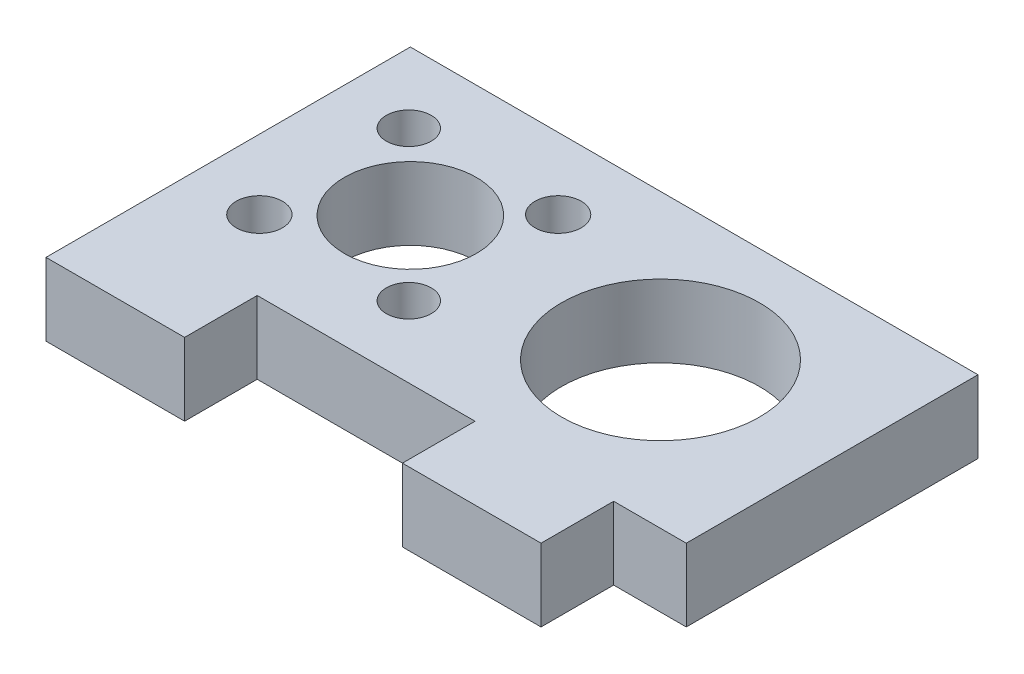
ISO-10303-21;
HEADER;
FILE_DESCRIPTION(('STEP AP214'),'2;1');
FILE_NAME('part.step','',(''),(''),'','','');
FILE_SCHEMA(('AUTOMOTIVE_DESIGN { 1 0 10303 214 1 1 1 1 }'));
ENDSEC;
DATA;
#1=APPLICATION_CONTEXT('core data for automotive mechanical design processes');
#2=APPLICATION_PROTOCOL_DEFINITION('international standard','automotive_design',2000,#1);
#3=PRODUCT_CONTEXT('',#1,'mechanical');
#4=PRODUCT('Part','Part','',(#3));
#5=PRODUCT_RELATED_PRODUCT_CATEGORY('part','',(#4));
#6=PRODUCT_DEFINITION_FORMATION('','',#4);
#7=PRODUCT_DEFINITION_CONTEXT('part definition',#1,'design');
#8=PRODUCT_DEFINITION('design','',#6,#7);
#9=PRODUCT_DEFINITION_SHAPE('','',#8);
#10=(LENGTH_UNIT() NAMED_UNIT(*) SI_UNIT(.MILLI.,.METRE.));
#11=(NAMED_UNIT(*) PLANE_ANGLE_UNIT() SI_UNIT($,.RADIAN.));
#12=(NAMED_UNIT(*) SI_UNIT($,.STERADIAN.) SOLID_ANGLE_UNIT());
#13=UNCERTAINTY_MEASURE_WITH_UNIT(LENGTH_MEASURE(1.E-05),#10,'distance_accuracy_value','');
#14=(GEOMETRIC_REPRESENTATION_CONTEXT(3) GLOBAL_UNCERTAINTY_ASSIGNED_CONTEXT((#13)) GLOBAL_UNIT_ASSIGNED_CONTEXT((#10,
#11,#12)) REPRESENTATION_CONTEXT('',''));
#15=CARTESIAN_POINT('',(0.,0.,0.));
#16=DIRECTION('',(0.,0.,1.));
#17=DIRECTION('',(1.,0.,0.));
#18=AXIS2_PLACEMENT_3D('',#15,#16,#17);
#19=CARTESIAN_POINT('',(0.,5.5,0.));
#20=DIRECTION('',(0.,1.,0.));
#21=DIRECTION('',(0.,0.,1.));
#22=AXIS2_PLACEMENT_3D('',#19,#20,#21);
#23=PLANE('',#22);
#24=CARTESIAN_POINT('',(-32.1095609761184,5.5,-10.8901665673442));
#25=DIRECTION('',(0.,1.,0.));
#26=DIRECTION('',(0.,0.,1.));
#27=AXIS2_PLACEMENT_3D('',#24,#25,#26);
#28=CIRCLE('',#27,1.75);
#29=CARTESIAN_POINT('',(-32.1095609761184,5.5,-9.14016656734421));
#30=VERTEX_POINT('',#29);
#31=EDGE_CURVE('E276',#30,#30,#28,.T.);
#32=ORIENTED_EDGE('',*,*,#31,.F.);
#33=EDGE_LOOP('',(#32));
#34=FACE_BOUND('',#33,.T.);
#35=CARTESIAN_POINT('',(-32.1096361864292,5.5,-22.209924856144));
#36=DIRECTION('',(0.,1.,0.));
#37=DIRECTION('',(0.,0.,1.));
#38=AXIS2_PLACEMENT_3D('',#35,#36,#37);
#39=CIRCLE('',#38,1.7);
#40=CARTESIAN_POINT('',(-32.1096361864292,5.5,-20.509924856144));
#41=VERTEX_POINT('',#40);
#42=EDGE_CURVE('E260',#41,#41,#39,.T.);
#43=ORIENTED_EDGE('',*,*,#42,.F.);
#44=EDGE_LOOP('',(#43));
#45=FACE_BOUND('',#44,.T.);
#46=CARTESIAN_POINT('',(-26.3312728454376,5.5,-16.55));
#47=DIRECTION('',(0.,1.,0.));
#48=DIRECTION('',(0.,0.,1.));
#49=AXIS2_PLACEMENT_3D('',#46,#47,#48);
#50=CIRCLE('',#49,5.);
#51=CARTESIAN_POINT('',(-26.3312728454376,5.5,-11.55));
#52=VERTEX_POINT('',#51);
#53=EDGE_CURVE('E161',#52,#52,#50,.T.);
#54=ORIENTED_EDGE('',*,*,#53,.F.);
#55=EDGE_LOOP('',(#54));
#56=FACE_BOUND('',#55,.T.);
#57=DIRECTION('',(1.,0.,0.));
#58=VECTOR('',#57,1.);
#59=CARTESIAN_POINT('',(0.118727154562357,5.5,0.));
#60=LINE('',#59,#58);
#61=CARTESIAN_POINT('',(-10.3812728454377,5.5,0.));
#62=VERTEX_POINT('',#61);
#63=CARTESIAN_POINT('',(0.118727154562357,5.5,0.));
#64=VERTEX_POINT('',#63);
#65=EDGE_CURVE('E57',#62,#64,#60,.T.);
#66=ORIENTED_EDGE('',*,*,#65,.T.);
#67=DIRECTION('',(0.,0.,-1.));
#68=VECTOR('',#67,1.);
#69=CARTESIAN_POINT('',(0.118727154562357,5.5,-5.5));
#70=LINE('',#69,#68);
#71=CARTESIAN_POINT('',(0.118727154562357,5.5,-5.5));
#72=VERTEX_POINT('',#71);
#73=EDGE_CURVE('E107',#64,#72,#70,.T.);
#74=ORIENTED_EDGE('',*,*,#73,.T.);
#75=DIRECTION('',(1.,0.,0.));
#76=VECTOR('',#75,1.);
#77=CARTESIAN_POINT('',(5.61872715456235,5.5,-5.5));
#78=LINE('',#77,#76);
#79=CARTESIAN_POINT('',(5.61872715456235,5.5,-5.5));
#80=VERTEX_POINT('',#79);
#81=EDGE_CURVE('E215',#72,#80,#78,.T.);
#82=ORIENTED_EDGE('',*,*,#81,.T.);
#83=DIRECTION('',(0.,0.,-1.));
#84=VECTOR('',#83,1.);
#85=CARTESIAN_POINT('',(5.61872715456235,5.5,-13.3164696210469));
#86=LINE('',#85,#84);
#87=CARTESIAN_POINT('',(5.61872715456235,5.5,-27.6));
#88=VERTEX_POINT('',#87);
#89=EDGE_CURVE('E234',#80,#88,#86,.T.);
#90=ORIENTED_EDGE('',*,*,#89,.T.);
#91=DIRECTION('',(-1.,0.,0.));
#92=VECTOR('',#91,1.);
#93=CARTESIAN_POINT('',(0.11872715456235,5.5,-27.6));
#94=LINE('',#93,#92);
#95=CARTESIAN_POINT('',(-37.3812728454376,5.5,-27.6));
#96=VERTEX_POINT('',#95);
#97=EDGE_CURVE('E230',#88,#96,#94,.T.);
#98=ORIENTED_EDGE('',*,*,#97,.T.);
#99=DIRECTION('',(0.,0.,1.));
#100=VECTOR('',#99,1.);
#101=CARTESIAN_POINT('',(-37.3812728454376,5.5,-27.6));
#102=LINE('',#101,#100);
#103=CARTESIAN_POINT('',(-37.3812728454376,5.5,0.));
#104=VERTEX_POINT('',#103);
#105=EDGE_CURVE('E233',#96,#104,#102,.T.);
#106=ORIENTED_EDGE('',*,*,#105,.T.);
#107=DIRECTION('',(1.,0.,0.));
#108=VECTOR('',#107,1.);
#109=CARTESIAN_POINT('',(-37.3812728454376,5.5,0.));
#110=LINE('',#109,#108);
#111=CARTESIAN_POINT('',(-26.8812728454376,5.5,0.));
#112=VERTEX_POINT('',#111);
#113=EDGE_CURVE('E133',#104,#112,#110,.T.);
#114=ORIENTED_EDGE('',*,*,#113,.T.);
#115=DIRECTION('',(0.,0.,-1.));
#116=VECTOR('',#115,1.);
#117=CARTESIAN_POINT('',(-26.8812728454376,5.5,0.));
#118=LINE('',#117,#116);
#119=CARTESIAN_POINT('',(-26.8812728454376,5.5,-5.5));
#120=VERTEX_POINT('',#119);
#121=EDGE_CURVE('E127',#112,#120,#118,.T.);
#122=ORIENTED_EDGE('',*,*,#121,.T.);
#123=DIRECTION('',(1.,0.,0.));
#124=VECTOR('',#123,1.);
#125=CARTESIAN_POINT('',(-26.8812728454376,5.5,-5.5));
#126=LINE('',#125,#124);
#127=CARTESIAN_POINT('',(-10.3812728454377,5.5,-5.5));
#128=VERTEX_POINT('',#127);
#129=EDGE_CURVE('E131',#120,#128,#126,.T.);
#130=ORIENTED_EDGE('',*,*,#129,.T.);
#131=DIRECTION('',(0.,0.,1.));
#132=VECTOR('',#131,1.);
#133=CARTESIAN_POINT('',(-10.3812728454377,5.5,-5.5));
#134=LINE('',#133,#132);
#135=EDGE_CURVE('E150',#128,#62,#134,.T.);
#136=ORIENTED_EDGE('',*,*,#135,.T.);
#137=EDGE_LOOP('',(#66,#74,#82,#90,#98,#106,#114,#122,#130,#136));
#138=FACE_BOUND('',#137,.T.);
#139=CARTESIAN_POINT('',(-7.38127284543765,5.5,-16.55));
#140=DIRECTION('',(0.,1.,0.));
#141=DIRECTION('',(0.,0.,1.));
#142=AXIS2_PLACEMENT_3D('',#139,#140,#141);
#143=CIRCLE('',#142,7.5);
#144=CARTESIAN_POINT('',(-7.38127284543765,5.5,-9.05));
#145=VERTEX_POINT('',#144);
#146=EDGE_CURVE('E252',#145,#145,#143,.T.);
#147=ORIENTED_EDGE('',*,*,#146,.F.);
#148=EDGE_LOOP('',(#147));
#149=FACE_BOUND('',#148,.T.);
#150=CARTESIAN_POINT('',(-20.7931457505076,5.5,-22.2068542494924));
#151=DIRECTION('',(0.,1.,0.));
#152=DIRECTION('',(0.,0.,1.));
#153=AXIS2_PLACEMENT_3D('',#150,#151,#152);
#154=CIRCLE('',#153,1.75);
#155=CARTESIAN_POINT('',(-20.7931457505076,5.5,-20.4568542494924));
#156=VERTEX_POINT('',#155);
#157=EDGE_CURVE('E268',#156,#156,#154,.T.);
#158=ORIENTED_EDGE('',*,*,#157,.F.);
#159=EDGE_LOOP('',(#158));
#160=FACE_BOUND('',#159,.T.);
#161=CARTESIAN_POINT('',(-20.7931457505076,5.5,-10.8931457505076));
#162=DIRECTION('',(0.,1.,0.));
#163=DIRECTION('',(0.,0.,1.));
#164=AXIS2_PLACEMENT_3D('',#161,#162,#163);
#165=CIRCLE('',#164,1.7);
#166=CARTESIAN_POINT('',(-20.7931457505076,5.5,-9.19314575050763));
#167=VERTEX_POINT('',#166);
#168=EDGE_CURVE('E284',#167,#167,#165,.T.);
#169=ORIENTED_EDGE('',*,*,#168,.F.);
#170=EDGE_LOOP('',(#169));
#171=FACE_BOUND('',#170,.T.);
#172=ADVANCED_FACE('F39',(#34,#45,#56,#138,#149,#160,#171),#23,.T.);
#173=CARTESIAN_POINT('',(0.,0.,0.));
#174=DIRECTION('',(0.,1.,0.));
#175=DIRECTION('',(0.,0.,1.));
#176=AXIS2_PLACEMENT_3D('',#173,#174,#175);
#177=PLANE('',#176);
#178=DIRECTION('',(0.,0.,-1.));
#179=VECTOR('',#178,1.);
#180=CARTESIAN_POINT('',(0.118727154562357,0.,-5.5));
#181=LINE('',#180,#179);
#182=CARTESIAN_POINT('',(0.118727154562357,0.,0.));
#183=VERTEX_POINT('',#182);
#184=CARTESIAN_POINT('',(0.118727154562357,0.,-5.5));
#185=VERTEX_POINT('',#184);
#186=EDGE_CURVE('E157',#183,#185,#181,.T.);
#187=ORIENTED_EDGE('',*,*,#186,.F.);
#188=DIRECTION('',(1.,0.,0.));
#189=VECTOR('',#188,1.);
#190=CARTESIAN_POINT('',(-10.3812728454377,0.,0.));
#191=LINE('',#190,#189);
#192=CARTESIAN_POINT('',(-10.3812728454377,0.,0.));
#193=VERTEX_POINT('',#192);
#194=EDGE_CURVE('E184',#193,#183,#191,.T.);
#195=ORIENTED_EDGE('',*,*,#194,.F.);
#196=DIRECTION('',(0.,0.,1.));
#197=VECTOR('',#196,1.);
#198=CARTESIAN_POINT('',(-10.3812728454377,0.,-5.5));
#199=LINE('',#198,#197);
#200=CARTESIAN_POINT('',(-10.3812728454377,0.,-5.5));
#201=VERTEX_POINT('',#200);
#202=EDGE_CURVE('E100',#201,#193,#199,.T.);
#203=ORIENTED_EDGE('',*,*,#202,.F.);
#204=DIRECTION('',(1.,0.,0.));
#205=VECTOR('',#204,1.);
#206=CARTESIAN_POINT('',(-26.8812728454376,0.,-5.5));
#207=LINE('',#206,#205);
#208=CARTESIAN_POINT('',(-26.8812728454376,0.,-5.5));
#209=VERTEX_POINT('',#208);
#210=EDGE_CURVE('E93',#209,#201,#207,.T.);
#211=ORIENTED_EDGE('',*,*,#210,.F.);
#212=DIRECTION('',(0.,0.,-1.));
#213=VECTOR('',#212,1.);
#214=CARTESIAN_POINT('',(-26.8812728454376,0.,0.));
#215=LINE('',#214,#213);
#216=CARTESIAN_POINT('',(-26.8812728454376,0.,0.));
#217=VERTEX_POINT('',#216);
#218=EDGE_CURVE('E142',#217,#209,#215,.T.);
#219=ORIENTED_EDGE('',*,*,#218,.F.);
#220=DIRECTION('',(1.,0.,0.));
#221=VECTOR('',#220,1.);
#222=CARTESIAN_POINT('',(-37.3812728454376,0.,0.));
#223=LINE('',#222,#221);
#224=CARTESIAN_POINT('',(-37.3812728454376,0.,0.));
#225=VERTEX_POINT('',#224);
#226=EDGE_CURVE('E175',#225,#217,#223,.T.);
#227=ORIENTED_EDGE('',*,*,#226,.F.);
#228=DIRECTION('',(0.,0.,1.));
#229=VECTOR('',#228,1.);
#230=CARTESIAN_POINT('',(-37.3812728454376,0.,-27.6));
#231=LINE('',#230,#229);
#232=CARTESIAN_POINT('',(-37.3812728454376,0.,-27.6));
#233=VERTEX_POINT('',#232);
#234=EDGE_CURVE('E172',#233,#225,#231,.T.);
#235=ORIENTED_EDGE('',*,*,#234,.F.);
#236=DIRECTION('',(-1.,0.,0.));
#237=VECTOR('',#236,1.);
#238=CARTESIAN_POINT('',(-37.3812728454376,0.,-27.6));
#239=LINE('',#238,#237);
#240=CARTESIAN_POINT('',(5.61872715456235,0.,-27.6));
#241=VERTEX_POINT('',#240);
#242=EDGE_CURVE('E169',#241,#233,#239,.T.);
#243=ORIENTED_EDGE('',*,*,#242,.F.);
#244=DIRECTION('',(0.,0.,-1.));
#245=VECTOR('',#244,1.);
#246=CARTESIAN_POINT('',(5.61872715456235,0.,-27.6));
#247=LINE('',#246,#245);
#248=CARTESIAN_POINT('',(5.61872715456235,0.,-5.5));
#249=VERTEX_POINT('',#248);
#250=EDGE_CURVE('E165',#249,#241,#247,.T.);
#251=ORIENTED_EDGE('',*,*,#250,.F.);
#252=DIRECTION('',(1.,0.,0.));
#253=VECTOR('',#252,1.);
#254=CARTESIAN_POINT('',(5.61872715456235,0.,-5.5));
#255=LINE('',#254,#253);
#256=EDGE_CURVE('E160',#185,#249,#255,.T.);
#257=ORIENTED_EDGE('',*,*,#256,.F.);
#258=EDGE_LOOP('',(#187,#195,#203,#211,#219,#227,#235,#243,#251,#257));
#259=FACE_BOUND('',#258,.T.);
#260=CARTESIAN_POINT('',(-26.3312728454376,0.,-16.55));
#261=DIRECTION('',(0.,1.,0.));
#262=DIRECTION('',(0.,0.,1.));
#263=AXIS2_PLACEMENT_3D('',#260,#261,#262);
#264=CIRCLE('',#263,5.);
#265=CARTESIAN_POINT('',(-26.3312728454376,0.,-11.55));
#266=VERTEX_POINT('',#265);
#267=EDGE_CURVE('E248',#266,#266,#264,.T.);
#268=ORIENTED_EDGE('',*,*,#267,.T.);
#269=EDGE_LOOP('',(#268));
#270=FACE_BOUND('',#269,.T.);
#271=CARTESIAN_POINT('',(-7.38127284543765,0.,-16.55));
#272=DIRECTION('',(0.,1.,0.));
#273=DIRECTION('',(0.,0.,1.));
#274=AXIS2_PLACEMENT_3D('',#271,#272,#273);
#275=CIRCLE('',#274,7.5);
#276=CARTESIAN_POINT('',(-7.38127284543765,0.,-9.05));
#277=VERTEX_POINT('',#276);
#278=EDGE_CURVE('E256',#277,#277,#275,.T.);
#279=ORIENTED_EDGE('',*,*,#278,.T.);
#280=EDGE_LOOP('',(#279));
#281=FACE_BOUND('',#280,.T.);
#282=CARTESIAN_POINT('',(-32.1096361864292,0.,-22.209924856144));
#283=DIRECTION('',(0.,1.,0.));
#284=DIRECTION('',(0.,0.,1.));
#285=AXIS2_PLACEMENT_3D('',#282,#283,#284);
#286=CIRCLE('',#285,1.7);
#287=CARTESIAN_POINT('',(-32.1096361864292,0.,-20.509924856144));
#288=VERTEX_POINT('',#287);
#289=EDGE_CURVE('E264',#288,#288,#286,.T.);
#290=ORIENTED_EDGE('',*,*,#289,.T.);
#291=EDGE_LOOP('',(#290));
#292=FACE_BOUND('',#291,.T.);
#293=CARTESIAN_POINT('',(-20.7931457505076,0.,-22.2068542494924));
#294=DIRECTION('',(0.,1.,0.));
#295=DIRECTION('',(0.,0.,1.));
#296=AXIS2_PLACEMENT_3D('',#293,#294,#295);
#297=CIRCLE('',#296,1.75);
#298=CARTESIAN_POINT('',(-20.7931457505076,0.,-20.4568542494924));
#299=VERTEX_POINT('',#298);
#300=EDGE_CURVE('E272',#299,#299,#297,.T.);
#301=ORIENTED_EDGE('',*,*,#300,.T.);
#302=EDGE_LOOP('',(#301));
#303=FACE_BOUND('',#302,.T.);
#304=CARTESIAN_POINT('',(-32.1095609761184,0.,-10.8901665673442));
#305=DIRECTION('',(0.,1.,0.));
#306=DIRECTION('',(0.,0.,1.));
#307=AXIS2_PLACEMENT_3D('',#304,#305,#306);
#308=CIRCLE('',#307,1.75);
#309=CARTESIAN_POINT('',(-32.1095609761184,0.,-9.14016656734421));
#310=VERTEX_POINT('',#309);
#311=EDGE_CURVE('E280',#310,#310,#308,.T.);
#312=ORIENTED_EDGE('',*,*,#311,.T.);
#313=EDGE_LOOP('',(#312));
#314=FACE_BOUND('',#313,.T.);
#315=CARTESIAN_POINT('',(-20.7931457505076,0.,-10.8931457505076));
#316=DIRECTION('',(0.,1.,0.));
#317=DIRECTION('',(0.,0.,1.));
#318=AXIS2_PLACEMENT_3D('',#315,#316,#317);
#319=CIRCLE('',#318,1.7);
#320=CARTESIAN_POINT('',(-20.7931457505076,0.,-9.19314575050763));
#321=VERTEX_POINT('',#320);
#322=EDGE_CURVE('E288',#321,#321,#319,.T.);
#323=ORIENTED_EDGE('',*,*,#322,.T.);
#324=EDGE_LOOP('',(#323));
#325=FACE_BOUND('',#324,.T.);
#326=ADVANCED_FACE('F218',(#259,#270,#281,#292,#303,#314,#325),#177,.F.);
#327=CARTESIAN_POINT('',(0.118727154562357,5.5,-5.5));
#328=DIRECTION('',(-1.,0.,0.));
#329=DIRECTION('',(0.,0.,1.));
#330=AXIS2_PLACEMENT_3D('',#327,#328,#329);
#331=PLANE('',#330);
#332=ORIENTED_EDGE('',*,*,#186,.T.);
#333=DIRECTION('',(0.,-1.,0.));
#334=VECTOR('',#333,1.);
#335=CARTESIAN_POINT('',(0.118727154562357,5.5,-5.5));
#336=LINE('',#335,#334);
#337=EDGE_CURVE('E49',#72,#185,#336,.T.);
#338=ORIENTED_EDGE('',*,*,#337,.F.);
#339=ORIENTED_EDGE('',*,*,#73,.F.);
#340=DIRECTION('',(0.,-1.,0.));
#341=VECTOR('',#340,1.);
#342=CARTESIAN_POINT('',(0.118727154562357,5.5,0.));
#343=LINE('',#342,#341);
#344=EDGE_CURVE('E11',#64,#183,#343,.T.);
#345=ORIENTED_EDGE('',*,*,#344,.T.);
#346=EDGE_LOOP('',(#332,#338,#339,#345));
#347=FACE_BOUND('',#346,.T.);
#348=ADVANCED_FACE('F41',(#347),#331,.F.);
#349=CARTESIAN_POINT('',(5.61872715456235,5.5,-5.5));
#350=DIRECTION('',(0.,0.,-1.));
#351=DIRECTION('',(-1.,0.,0.));
#352=AXIS2_PLACEMENT_3D('',#349,#350,#351);
#353=PLANE('',#352);
#354=ORIENTED_EDGE('',*,*,#256,.T.);
#355=DIRECTION('',(0.,-1.,0.));
#356=VECTOR('',#355,1.);
#357=CARTESIAN_POINT('',(5.61872715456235,5.5,-5.5));
#358=LINE('',#357,#356);
#359=EDGE_CURVE('E205',#80,#249,#358,.T.);
#360=ORIENTED_EDGE('',*,*,#359,.F.);
#361=ORIENTED_EDGE('',*,*,#81,.F.);
#362=ORIENTED_EDGE('',*,*,#337,.T.);
#363=EDGE_LOOP('',(#354,#360,#361,#362));
#364=FACE_BOUND('',#363,.T.);
#365=ADVANCED_FACE('F213',(#364),#353,.F.);
#366=CARTESIAN_POINT('',(5.61872715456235,5.5,-27.6));
#367=DIRECTION('',(-1.,0.,0.));
#368=DIRECTION('',(0.,0.,1.));
#369=AXIS2_PLACEMENT_3D('',#366,#367,#368);
#370=PLANE('',#369);
#371=ORIENTED_EDGE('',*,*,#250,.T.);
#372=DIRECTION('',(0.,-1.,0.));
#373=VECTOR('',#372,1.);
#374=CARTESIAN_POINT('',(5.61872715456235,5.5,-27.6));
#375=LINE('',#374,#373);
#376=EDGE_CURVE('E201',#88,#241,#375,.T.);
#377=ORIENTED_EDGE('',*,*,#376,.F.);
#378=ORIENTED_EDGE('',*,*,#89,.F.);
#379=ORIENTED_EDGE('',*,*,#359,.T.);
#380=EDGE_LOOP('',(#371,#377,#378,#379));
#381=FACE_BOUND('',#380,.T.);
#382=ADVANCED_FACE('F224',(#381),#370,.F.);
#383=CARTESIAN_POINT('',(-37.3812728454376,5.5,-27.6));
#384=DIRECTION('',(0.,0.,1.));
#385=DIRECTION('',(1.,0.,0.));
#386=AXIS2_PLACEMENT_3D('',#383,#384,#385);
#387=PLANE('',#386);
#388=ORIENTED_EDGE('',*,*,#242,.T.);
#389=DIRECTION('',(0.,-1.,0.));
#390=VECTOR('',#389,1.);
#391=CARTESIAN_POINT('',(-37.3812728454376,5.5,-27.6));
#392=LINE('',#391,#390);
#393=EDGE_CURVE('E197',#96,#233,#392,.T.);
#394=ORIENTED_EDGE('',*,*,#393,.F.);
#395=ORIENTED_EDGE('',*,*,#97,.F.);
#396=ORIENTED_EDGE('',*,*,#376,.T.);
#397=EDGE_LOOP('',(#388,#394,#395,#396));
#398=FACE_BOUND('',#397,.T.);
#399=ADVANCED_FACE('F228',(#398),#387,.F.);
#400=CARTESIAN_POINT('',(-37.3812728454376,5.5,-27.6));
#401=DIRECTION('',(1.,0.,0.));
#402=DIRECTION('',(0.,0.,-1.));
#403=AXIS2_PLACEMENT_3D('',#400,#401,#402);
#404=PLANE('',#403);
#405=ORIENTED_EDGE('',*,*,#234,.T.);
#406=DIRECTION('',(0.,-1.,0.));
#407=VECTOR('',#406,1.);
#408=CARTESIAN_POINT('',(-37.3812728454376,5.5,0.));
#409=LINE('',#408,#407);
#410=EDGE_CURVE('E193',#104,#225,#409,.T.);
#411=ORIENTED_EDGE('',*,*,#410,.F.);
#412=ORIENTED_EDGE('',*,*,#105,.F.);
#413=ORIENTED_EDGE('',*,*,#393,.T.);
#414=EDGE_LOOP('',(#405,#411,#412,#413));
#415=FACE_BOUND('',#414,.T.);
#416=ADVANCED_FACE('F325',(#415),#404,.F.);
#417=CARTESIAN_POINT('',(-37.3812728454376,5.5,0.));
#418=DIRECTION('',(0.,0.,-1.));
#419=DIRECTION('',(-1.,0.,0.));
#420=AXIS2_PLACEMENT_3D('',#417,#418,#419);
#421=PLANE('',#420);
#422=ORIENTED_EDGE('',*,*,#226,.T.);
#423=DIRECTION('',(0.,-1.,0.));
#424=VECTOR('',#423,1.);
#425=CARTESIAN_POINT('',(-26.8812728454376,5.5,0.));
#426=LINE('',#425,#424);
#427=EDGE_CURVE('E144',#112,#217,#426,.T.);
#428=ORIENTED_EDGE('',*,*,#427,.F.);
#429=ORIENTED_EDGE('',*,*,#113,.F.);
#430=ORIENTED_EDGE('',*,*,#410,.T.);
#431=EDGE_LOOP('',(#422,#428,#429,#430));
#432=FACE_BOUND('',#431,.T.);
#433=ADVANCED_FACE('F322',(#432),#421,.F.);
#434=CARTESIAN_POINT('',(-26.8812728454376,5.5,0.));
#435=DIRECTION('',(-1.,0.,0.));
#436=DIRECTION('',(0.,0.,1.));
#437=AXIS2_PLACEMENT_3D('',#434,#435,#436);
#438=PLANE('',#437);
#439=ORIENTED_EDGE('',*,*,#218,.T.);
#440=DIRECTION('',(0.,-1.,0.));
#441=VECTOR('',#440,1.);
#442=CARTESIAN_POINT('',(-26.8812728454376,5.5,-5.5));
#443=LINE('',#442,#441);
#444=EDGE_CURVE('E139',#120,#209,#443,.T.);
#445=ORIENTED_EDGE('',*,*,#444,.F.);
#446=ORIENTED_EDGE('',*,*,#121,.F.);
#447=ORIENTED_EDGE('',*,*,#427,.T.);
#448=EDGE_LOOP('',(#439,#445,#446,#447));
#449=FACE_BOUND('',#448,.T.);
#450=ADVANCED_FACE('F140',(#449),#438,.F.);
#451=CARTESIAN_POINT('',(-26.8812728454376,5.5,-5.5));
#452=DIRECTION('',(0.,0.,-1.));
#453=DIRECTION('',(-1.,0.,0.));
#454=AXIS2_PLACEMENT_3D('',#451,#452,#453);
#455=PLANE('',#454);
#456=ORIENTED_EDGE('',*,*,#210,.T.);
#457=DIRECTION('',(0.,-1.,0.));
#458=VECTOR('',#457,1.);
#459=CARTESIAN_POINT('',(-10.3812728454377,5.5,-5.5));
#460=LINE('',#459,#458);
#461=EDGE_CURVE('E145',#128,#201,#460,.T.);
#462=ORIENTED_EDGE('',*,*,#461,.F.);
#463=ORIENTED_EDGE('',*,*,#129,.F.);
#464=ORIENTED_EDGE('',*,*,#444,.T.);
#465=EDGE_LOOP('',(#456,#462,#463,#464));
#466=FACE_BOUND('',#465,.T.);
#467=ADVANCED_FACE('F147',(#466),#455,.F.);
#468=CARTESIAN_POINT('',(-10.3812728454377,5.5,-5.5));
#469=DIRECTION('',(1.,0.,0.));
#470=DIRECTION('',(0.,0.,-1.));
#471=AXIS2_PLACEMENT_3D('',#468,#469,#470);
#472=PLANE('',#471);
#473=ORIENTED_EDGE('',*,*,#202,.T.);
#474=DIRECTION('',(0.,-1.,0.));
#475=VECTOR('',#474,1.);
#476=CARTESIAN_POINT('',(-10.3812728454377,5.5,0.));
#477=LINE('',#476,#475);
#478=EDGE_CURVE('E153',#62,#193,#477,.T.);
#479=ORIENTED_EDGE('',*,*,#478,.F.);
#480=ORIENTED_EDGE('',*,*,#135,.F.);
#481=ORIENTED_EDGE('',*,*,#461,.T.);
#482=EDGE_LOOP('',(#473,#479,#480,#481));
#483=FACE_BOUND('',#482,.T.);
#484=ADVANCED_FACE('F315',(#483),#472,.F.);
#485=CARTESIAN_POINT('',(-10.3812728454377,5.5,0.));
#486=DIRECTION('',(0.,0.,-1.));
#487=DIRECTION('',(-1.,0.,0.));
#488=AXIS2_PLACEMENT_3D('',#485,#486,#487);
#489=PLANE('',#488);
#490=ORIENTED_EDGE('',*,*,#194,.T.);
#491=ORIENTED_EDGE('',*,*,#344,.F.);
#492=ORIENTED_EDGE('',*,*,#65,.F.);
#493=ORIENTED_EDGE('',*,*,#478,.T.);
#494=EDGE_LOOP('',(#490,#491,#492,#493));
#495=FACE_BOUND('',#494,.T.);
#496=ADVANCED_FACE('F312',(#495),#489,.F.);
#497=CARTESIAN_POINT('',(-26.3312728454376,5.5,-16.55));
#498=DIRECTION('',(0.,-1.,0.));
#499=DIRECTION('',(0.,0.,-1.));
#500=AXIS2_PLACEMENT_3D('',#497,#498,#499);
#501=CYLINDRICAL_SURFACE('',#500,5.);
#502=ORIENTED_EDGE('',*,*,#53,.T.);
#503=EDGE_LOOP('',(#502));
#504=FACE_BOUND('',#503,.T.);
#505=ORIENTED_EDGE('',*,*,#267,.F.);
#506=EDGE_LOOP('',(#505));
#507=FACE_BOUND('',#506,.T.);
#508=ADVANCED_FACE('F309',(#504,#507),#501,.F.);
#509=CARTESIAN_POINT('',(-7.38127284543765,5.5,-16.55));
#510=DIRECTION('',(0.,-1.,0.));
#511=DIRECTION('',(0.,0.,-1.));
#512=AXIS2_PLACEMENT_3D('',#509,#510,#511);
#513=CYLINDRICAL_SURFACE('',#512,7.5);
#514=ORIENTED_EDGE('',*,*,#146,.T.);
#515=EDGE_LOOP('',(#514));
#516=FACE_BOUND('',#515,.T.);
#517=ORIENTED_EDGE('',*,*,#278,.F.);
#518=EDGE_LOOP('',(#517));
#519=FACE_BOUND('',#518,.T.);
#520=ADVANCED_FACE('F417',(#516,#519),#513,.F.);
#521=CARTESIAN_POINT('',(-32.1096361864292,5.5,-22.209924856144));
#522=DIRECTION('',(0.,-1.,0.));
#523=DIRECTION('',(0.,0.,-1.));
#524=AXIS2_PLACEMENT_3D('',#521,#522,#523);
#525=CYLINDRICAL_SURFACE('',#524,1.7);
#526=ORIENTED_EDGE('',*,*,#42,.T.);
#527=EDGE_LOOP('',(#526));
#528=FACE_BOUND('',#527,.T.);
#529=ORIENTED_EDGE('',*,*,#289,.F.);
#530=EDGE_LOOP('',(#529));
#531=FACE_BOUND('',#530,.T.);
#532=ADVANCED_FACE('F425',(#528,#531),#525,.F.);
#533=CARTESIAN_POINT('',(-20.7931457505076,5.5,-22.2068542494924));
#534=DIRECTION('',(0.,-1.,0.));
#535=DIRECTION('',(0.,0.,-1.));
#536=AXIS2_PLACEMENT_3D('',#533,#534,#535);
#537=CYLINDRICAL_SURFACE('',#536,1.75);
#538=ORIENTED_EDGE('',*,*,#157,.T.);
#539=EDGE_LOOP('',(#538));
#540=FACE_BOUND('',#539,.T.);
#541=ORIENTED_EDGE('',*,*,#300,.F.);
#542=EDGE_LOOP('',(#541));
#543=FACE_BOUND('',#542,.T.);
#544=ADVANCED_FACE('F433',(#540,#543),#537,.F.);
#545=CARTESIAN_POINT('',(-32.1095609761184,5.5,-10.8901665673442));
#546=DIRECTION('',(0.,-1.,0.));
#547=DIRECTION('',(0.,0.,-1.));
#548=AXIS2_PLACEMENT_3D('',#545,#546,#547);
#549=CYLINDRICAL_SURFACE('',#548,1.75);
#550=ORIENTED_EDGE('',*,*,#31,.T.);
#551=EDGE_LOOP('',(#550));
#552=FACE_BOUND('',#551,.T.);
#553=ORIENTED_EDGE('',*,*,#311,.F.);
#554=EDGE_LOOP('',(#553));
#555=FACE_BOUND('',#554,.T.);
#556=ADVANCED_FACE('F442',(#552,#555),#549,.F.);
#557=CARTESIAN_POINT('',(-20.7931457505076,5.5,-10.8931457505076));
#558=DIRECTION('',(0.,-1.,0.));
#559=DIRECTION('',(0.,0.,-1.));
#560=AXIS2_PLACEMENT_3D('',#557,#558,#559);
#561=CYLINDRICAL_SURFACE('',#560,1.7);
#562=ORIENTED_EDGE('',*,*,#168,.T.);
#563=EDGE_LOOP('',(#562));
#564=FACE_BOUND('',#563,.T.);
#565=ORIENTED_EDGE('',*,*,#322,.F.);
#566=EDGE_LOOP('',(#565));
#567=FACE_BOUND('',#566,.T.);
#568=ADVANCED_FACE('F296',(#564,#567),#561,.F.);
#569=CLOSED_SHELL('',(#172,#326,#348,#365,#382,#399,#416,#433,#450,#467,#484,#496,#508,#520,
#532,#544,#556,#568));
#570=MANIFOLD_SOLID_BREP('B2',#569);
#571=ADVANCED_BREP_SHAPE_REPRESENTATION('',(#18,#570),#14);
#572=SHAPE_DEFINITION_REPRESENTATION(#9,#571);
ENDSEC;
END-ISO-10303-21;
